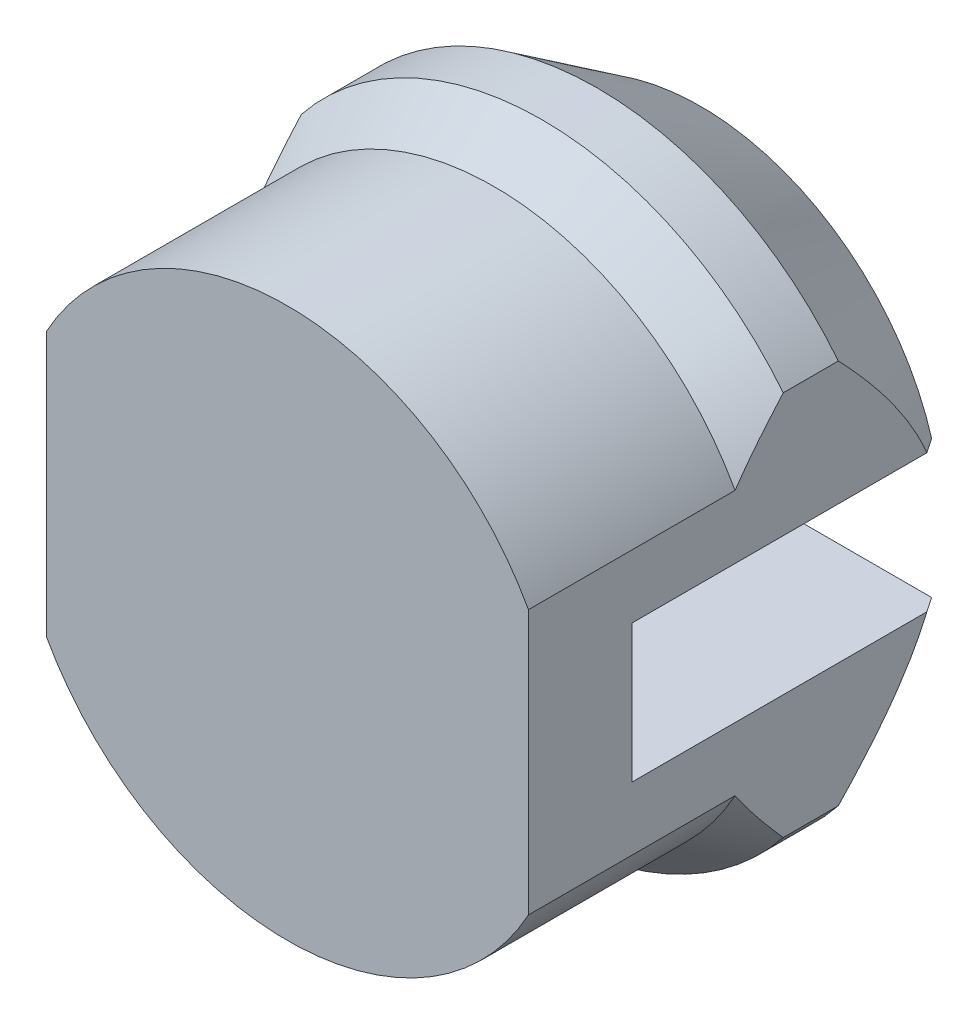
ISO-10303-21;
HEADER;
FILE_DESCRIPTION(('STEP AP214'),'2;1');
FILE_NAME('part.step','',(''),(''),'','','');
FILE_SCHEMA(('AUTOMOTIVE_DESIGN { 1 0 10303 214 1 1 1 1 }'));
ENDSEC;
DATA;
#1=APPLICATION_CONTEXT('core data for automotive mechanical design processes');
#2=APPLICATION_PROTOCOL_DEFINITION('international standard','automotive_design',2000,#1);
#3=PRODUCT_CONTEXT('',#1,'mechanical');
#4=PRODUCT('Part','Part','',(#3));
#5=PRODUCT_RELATED_PRODUCT_CATEGORY('part','',(#4));
#6=PRODUCT_DEFINITION_FORMATION('','',#4);
#7=PRODUCT_DEFINITION_CONTEXT('part definition',#1,'design');
#8=PRODUCT_DEFINITION('design','',#6,#7);
#9=PRODUCT_DEFINITION_SHAPE('','',#8);
#10=(LENGTH_UNIT() NAMED_UNIT(*) SI_UNIT(.MILLI.,.METRE.));
#11=(NAMED_UNIT(*) PLANE_ANGLE_UNIT() SI_UNIT($,.RADIAN.));
#12=(NAMED_UNIT(*) SI_UNIT($,.STERADIAN.) SOLID_ANGLE_UNIT());
#13=UNCERTAINTY_MEASURE_WITH_UNIT(LENGTH_MEASURE(1.E-05),#10,'distance_accuracy_value','');
#14=(GEOMETRIC_REPRESENTATION_CONTEXT(3) GLOBAL_UNCERTAINTY_ASSIGNED_CONTEXT((#13)) GLOBAL_UNIT_ASSIGNED_CONTEXT((#10,
#11,#12)) REPRESENTATION_CONTEXT('',''));
#15=CARTESIAN_POINT('',(0.,0.,0.));
#16=DIRECTION('',(0.,0.,1.));
#17=DIRECTION('',(1.,0.,0.));
#18=AXIS2_PLACEMENT_3D('',#15,#16,#17);
#19=CARTESIAN_POINT('',(0.,0.,-1.50000000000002));
#20=DIRECTION('',(0.,0.,-1.));
#21=DIRECTION('',(-1.,0.,0.));
#22=AXIS2_PLACEMENT_3D('',#19,#20,#21);
#23=CYLINDRICAL_SURFACE('',#22,3.9917400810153);
#24=CARTESIAN_POINT('',(0.,0.,0.));
#25=DIRECTION('',(0.,0.,-1.));
#26=DIRECTION('',(-1.,0.,0.));
#27=AXIS2_PLACEMENT_3D('',#24,#25,#26);
#28=CIRCLE('',#27,3.9917400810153);
#29=CARTESIAN_POINT('',(3.50000000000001,-1.919372,0.));
#30=VERTEX_POINT('',#29);
#31=CARTESIAN_POINT('',(-3.49999999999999,-1.91937200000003,0.));
#32=VERTEX_POINT('',#31);
#33=EDGE_CURVE('E232',#30,#32,#28,.T.);
#34=ORIENTED_EDGE('',*,*,#33,.T.);
#35=DIRECTION('',(0.,0.,-1.));
#36=VECTOR('',#35,1.);
#37=CARTESIAN_POINT('',(-3.49999999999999,-1.91937200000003,-1.50000000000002));
#38=LINE('',#37,#36);
#39=CARTESIAN_POINT('',(-3.49999999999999,-1.91937200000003,-3.00000000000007));
#40=VERTEX_POINT('',#39);
#41=EDGE_CURVE('E163',#32,#40,#38,.T.);
#42=ORIENTED_EDGE('',*,*,#41,.T.);
#43=CARTESIAN_POINT('',(0.,0.,-3.00000000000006));
#44=DIRECTION('',(0.,0.,-1.));
#45=DIRECTION('',(-1.,0.,0.));
#46=AXIS2_PLACEMENT_3D('',#43,#44,#45);
#47=CIRCLE('',#46,3.9917400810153);
#48=CARTESIAN_POINT('',(3.50000000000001,-1.919372,-3.00000000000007));
#49=VERTEX_POINT('',#48);
#50=EDGE_CURVE('E234',#49,#40,#47,.T.);
#51=ORIENTED_EDGE('',*,*,#50,.F.);
#52=DIRECTION('',(0.,0.,-1.));
#53=VECTOR('',#52,1.);
#54=CARTESIAN_POINT('',(3.50000000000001,-1.919372,-1.50000000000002));
#55=LINE('',#54,#53);
#56=EDGE_CURVE('E300',#49,#30,#55,.F.);
#57=ORIENTED_EDGE('',*,*,#56,.T.);
#58=EDGE_LOOP('',(#34,#42,#51,#57));
#59=FACE_BOUND('',#58,.T.);
#60=ADVANCED_FACE('F31',(#59),#23,.T.);
#61=CARTESIAN_POINT('',(0.,0.,-4.50000000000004));
#62=DIRECTION('',(0.,0.,1.));
#63=DIRECTION('',(1.,0.,0.));
#64=AXIS2_PLACEMENT_3D('',#61,#62,#63);
#65=CONICAL_SURFACE('',#64,4.48005192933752,0.578739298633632);
#66=CARTESIAN_POINT('',(0.,0.,-4.50000000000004));
#67=DIRECTION('',(0.,0.,-1.));
#68=DIRECTION('',(-1.,0.,0.));
#69=AXIS2_PLACEMENT_3D('',#66,#67,#68);
#70=CIRCLE('',#69,4.48005192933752);
#71=CARTESIAN_POINT('',(3.50000000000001,-2.79658099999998,-4.50000000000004));
#72=VERTEX_POINT('',#71);
#73=CARTESIAN_POINT('',(-3.49999999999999,-2.79658099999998,-4.50000000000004));
#74=VERTEX_POINT('',#73);
#75=EDGE_CURVE('E179',#72,#74,#70,.T.);
#76=ORIENTED_EDGE('',*,*,#75,.T.);
#77=CARTESIAN_POINT('',(-3.49999999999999,-4.10913992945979,-3.09553037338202));
#78=CARTESIAN_POINT('',(-3.49999999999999,-4.01740323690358,-3.20239201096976));
#79=CARTESIAN_POINT('',(-3.49999999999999,-3.92494303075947,-3.30864234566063));
#80=CARTESIAN_POINT('',(-3.49999999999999,-3.73824976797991,-3.51962826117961));
#81=CARTESIAN_POINT('',(-3.49999999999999,-3.64401619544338,-3.62436338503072));
#82=CARTESIAN_POINT('',(-3.49999999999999,-3.45240665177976,-3.83315922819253));
#83=CARTESIAN_POINT('',(-3.49999999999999,-3.35500698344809,-3.93719827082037));
#84=CARTESIAN_POINT('',(-3.49999999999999,-3.15772319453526,-4.14287686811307));
#85=CARTESIAN_POINT('',(-3.49999999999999,-3.05783936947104,-4.24451670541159));
#86=CARTESIAN_POINT('',(-3.49999999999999,-2.84818236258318,-4.45158608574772));
#87=CARTESIAN_POINT('',(-3.49999999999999,-2.73819854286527,-4.55680341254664));
#88=CARTESIAN_POINT('',(-3.49999999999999,-2.51400086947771,-4.76274699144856));
#89=CARTESIAN_POINT('',(-3.49999999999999,-2.39978553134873,-4.86347163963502));
#90=CARTESIAN_POINT('',(-3.49999999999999,-2.1667709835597,-5.05831645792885));
#91=CARTESIAN_POINT('',(-3.49999999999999,-2.04799704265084,-5.15246663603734));
#92=CARTESIAN_POINT('',(-3.49999999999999,-1.80426647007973,-5.33232312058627));
#93=CARTESIAN_POINT('',(-3.49999999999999,-1.67931575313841,-5.41803727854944));
#94=CARTESIAN_POINT('',(-3.49999999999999,-1.48257030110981,-5.54000315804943));
#95=CARTESIAN_POINT('',(-3.49999999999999,-1.41343607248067,-5.58054753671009));
#96=CARTESIAN_POINT('',(-3.49999999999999,-1.2729099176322,-5.65760976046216));
#97=CARTESIAN_POINT('',(-3.49999999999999,-1.20151725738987,-5.69412627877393));
#98=CARTESIAN_POINT('',(-3.49999999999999,-1.0569944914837,-5.76203006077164));
#99=CARTESIAN_POINT('',(-3.49999999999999,-0.983882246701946,-5.79345505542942));
#100=CARTESIAN_POINT('',(-3.49999999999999,-0.835454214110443,-5.85059764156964));
#101=CARTESIAN_POINT('',(-3.49999999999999,-0.760138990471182,-5.87631668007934));
#102=CARTESIAN_POINT('',(-3.49999999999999,-0.61922833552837,-5.91767267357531));
#103=CARTESIAN_POINT('',(-3.49999999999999,-0.553909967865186,-5.93425031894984));
#104=CARTESIAN_POINT('',(-3.49999999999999,-0.422155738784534,-5.96209739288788));
#105=CARTESIAN_POINT('',(-3.49999999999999,-0.35572017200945,-5.97336819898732));
#106=CARTESIAN_POINT('',(-3.49999999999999,-0.222145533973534,-5.99018688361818));
#107=CARTESIAN_POINT('',(-3.49999999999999,-0.155006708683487,-5.99573669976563));
#108=CARTESIAN_POINT('',(-3.49999999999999,-0.0205219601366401,-6.00089493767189));
#109=CARTESIAN_POINT('',(-3.49999999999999,0.0468238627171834,-6.00050588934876));
#110=CARTESIAN_POINT('',(-3.49999999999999,0.162722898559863,-5.99473135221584));
#111=CARTESIAN_POINT('',(-3.49999999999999,0.211351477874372,-5.99074918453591));
#112=CARTESIAN_POINT('',(-3.49999999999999,0.308228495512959,-5.97977738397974));
#113=CARTESIAN_POINT('',(-3.49999999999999,0.356477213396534,-5.97279022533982));
#114=CARTESIAN_POINT('',(-3.49999999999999,0.404469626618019,-5.96434858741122));
#115=B_SPLINE_CURVE_WITH_KNOTS('',3,(#77,#78,#79,#80,#81,#82,#83,#84,#85,#86,#87,#88,#89,#90,
#91,#92,#93,#94,#95,#96,#97,#98,#99,#100,#101,#102,#103,#104,#105,#106,#107,#108,#109,#110,#111,
#112,#113,#114),.UNSPECIFIED.,.F.,.F.,(4,2,2,2,2,2,2,2,2,2,2,2,2,2,2,2,2,2,4),(0.,
0.422518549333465,0.845161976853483,1.27267536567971,1.70013813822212,2.1566655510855,
2.61335466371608,3.06780075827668,3.52181981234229,3.76215227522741,4.00256366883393,
4.24110278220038,4.47958133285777,4.68155231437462,4.88347083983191,5.08532095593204,
5.28708508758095,5.43336879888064,5.57953229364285),.UNSPECIFIED.);
#116=CARTESIAN_POINT('',(-3.49999999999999,-1.,-5.78564128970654));
#117=VERTEX_POINT('',#116);
#118=EDGE_CURVE('E399',#74,#117,#115,.T.);
#119=ORIENTED_EDGE('',*,*,#118,.T.);
#120=CARTESIAN_POINT('',(-7.97919197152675,-1.,0.951075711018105));
#121=CARTESIAN_POINT('',(-7.7472725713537,-1.,0.598883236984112));
#122=CARTESIAN_POINT('',(-7.51525459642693,-1.,0.246755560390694));
#123=CARTESIAN_POINT('',(-7.05092636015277,-1.,-0.457314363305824));
#124=CARTESIAN_POINT('',(-6.8186160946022,-1.,-0.809256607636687));
#125=CARTESIAN_POINT('',(-6.35341867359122,-1.,-1.51318648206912));
#126=CARTESIAN_POINT('',(-6.12053119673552,-1.,-1.86517389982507));
#127=CARTESIAN_POINT('',(-5.6542268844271,-1.,-2.5687913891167));
#128=CARTESIAN_POINT('',(-5.4208100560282,-1.,-2.92042146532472));
#129=CARTESIAN_POINT('',(-4.94064613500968,-1.,-3.64203991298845));
#130=CARTESIAN_POINT('',(-4.69385642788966,-1.,-4.01199993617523));
#131=CARTESIAN_POINT('',(-4.19893806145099,-1.,-4.75104690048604));
#132=CARTESIAN_POINT('',(-3.95080934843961,-1.,-5.12013380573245));
#133=CARTESIAN_POINT('',(-3.57697381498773,-1.,-5.67248391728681));
#134=CARTESIAN_POINT('',(-3.45212785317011,-1.,-5.85632947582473));
#135=CARTESIAN_POINT('',(-3.20164422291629,-1.,-6.22348014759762));
#136=CARTESIAN_POINT('',(-3.07600655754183,-1.,-6.40678526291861));
#137=CARTESIAN_POINT('',(-2.82362434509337,-1.,-6.77261412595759));
#138=CARTESIAN_POINT('',(-2.69687987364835,-1.,-6.95513792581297));
#139=CARTESIAN_POINT('',(-2.44175614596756,-1.,-7.31903820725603));
#140=CARTESIAN_POINT('',(-2.31337692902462,-1.,-7.50041471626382));
#141=CARTESIAN_POINT('',(-2.13159270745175,-1.,-7.75336688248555));
#142=CARTESIAN_POINT('',(-2.07927557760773,-1.,-7.82572403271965));
#143=CARTESIAN_POINT('',(-1.97411799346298,-1.,-7.97005966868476));
#144=CARTESIAN_POINT('',(-1.92127752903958,-1.,-8.04203814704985));
#145=CARTESIAN_POINT('',(-1.81490032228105,-1.,-8.18557979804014));
#146=CARTESIAN_POINT('',(-1.76136299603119,-1.,-8.25714253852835));
#147=CARTESIAN_POINT('',(-1.65346601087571,-1.,-8.39964179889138));
#148=CARTESIAN_POINT('',(-1.59910638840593,-1.,-8.47057834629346));
#149=CARTESIAN_POINT('',(-1.48977579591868,-1.,-8.61103442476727));
#150=CARTESIAN_POINT('',(-1.43481368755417,-1.,-8.68056083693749));
#151=CARTESIAN_POINT('',(-1.32349988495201,-1.,-8.81849104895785));
#152=CARTESIAN_POINT('',(-1.26714827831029,-1.,-8.88689491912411));
#153=CARTESIAN_POINT('',(-1.15261507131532,-1.,-9.02201266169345));
#154=CARTESIAN_POINT('',(-1.09443583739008,-1.,-9.08872853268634));
#155=CARTESIAN_POINT('',(-0.975423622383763,-1.,-9.21973764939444));
#156=CARTESIAN_POINT('',(-0.914591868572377,-1.,-9.28403199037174));
#157=CARTESIAN_POINT('',(-0.828094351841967,-1.,-9.36986529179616));
#158=CARTESIAN_POINT('',(-0.80411577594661,-1.,-9.39310011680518));
#159=CARTESIAN_POINT('',(-0.755492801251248,-1.,-9.43886218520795));
#160=CARTESIAN_POINT('',(-0.730848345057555,-1.,-9.46138936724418));
#161=CARTESIAN_POINT('',(-0.655578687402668,-1.,-9.52783690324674));
#162=CARTESIAN_POINT('',(-0.603771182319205,-1.,-9.57046703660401));
#163=CARTESIAN_POINT('',(-0.522461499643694,-1.,-9.6304081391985));
#164=CARTESIAN_POINT('',(-0.494542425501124,-1.,-9.64984728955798));
#165=CARTESIAN_POINT('',(-0.437444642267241,-1.,-9.68676638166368));
#166=CARTESIAN_POINT('',(-0.408265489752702,-1.,-9.70424562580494));
#167=CARTESIAN_POINT('',(-0.318867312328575,-1.,-9.75264809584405));
#168=CARTESIAN_POINT('',(-0.256393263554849,-1.,-9.77984777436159));
#169=CARTESIAN_POINT('',(-0.153857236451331,-1.,-9.80934410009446));
#170=CARTESIAN_POINT('',(-0.115450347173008,-1.,-9.81730518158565));
#171=CARTESIAN_POINT('',(-0.0378388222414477,-1.,-9.82637065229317));
#172=CARTESIAN_POINT('',(0.00136475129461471,-1.,-9.82748363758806));
#173=CARTESIAN_POINT('',(0.0792862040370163,-1.,-9.82268210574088));
#174=CARTESIAN_POINT('',(0.11800444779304,-1.,-9.81677322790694));
#175=CARTESIAN_POINT('',(0.194001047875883,-1.,-9.79885597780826));
#176=CARTESIAN_POINT('',(0.231276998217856,-1.,-9.78683784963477));
#177=CARTESIAN_POINT('',(0.328286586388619,-1.,-9.748474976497));
#178=CARTESIAN_POINT('',(0.386330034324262,-1.,-9.71792657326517));
#179=CARTESIAN_POINT('',(0.469710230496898,-1.,-9.66634423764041));
#180=CARTESIAN_POINT('',(0.49695475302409,-1.,-9.64813585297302));
#181=CARTESIAN_POINT('',(0.550370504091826,-1.,-9.61020811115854));
#182=CARTESIAN_POINT('',(0.576542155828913,-1.,-9.59048935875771));
#183=CARTESIAN_POINT('',(0.650601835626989,-1.,-9.53201946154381));
#184=CARTESIAN_POINT('',(0.697319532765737,-1.,-9.49179865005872));
#185=CARTESIAN_POINT('',(0.788353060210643,-1.,-9.40870629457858));
#186=CARTESIAN_POINT('',(0.832667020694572,-1.,-9.36583274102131));
#187=CARTESIAN_POINT('',(0.919572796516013,-1.,-9.27818279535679));
#188=CARTESIAN_POINT('',(0.962160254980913,-1.,-9.23340211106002));
#189=CARTESIAN_POINT('',(1.04593650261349,-1.,-9.14254666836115));
#190=CARTESIAN_POINT('',(1.08712506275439,-1.,-9.09647170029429));
#191=CARTESIAN_POINT('',(1.20950826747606,-1.,-8.95634291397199));
#192=CARTESIAN_POINT('',(1.28906466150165,-1.,-8.86086070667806));
#193=CARTESIAN_POINT('',(1.406256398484,-1.,-8.71606234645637));
#194=CARTESIAN_POINT('',(1.44493328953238,-1.,-8.66757286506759));
#195=CARTESIAN_POINT('',(1.52171043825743,-1.,-8.57014026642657));
#196=CARTESIAN_POINT('',(1.55981071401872,-1.,-8.52119716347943));
#197=CARTESIAN_POINT('',(1.67229624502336,-1.,-8.37526663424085));
#198=CARTESIAN_POINT('',(1.74600429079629,-1.,-8.27775805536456));
#199=CARTESIAN_POINT('',(1.89212255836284,-1.,-8.08177139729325));
#200=CARTESIAN_POINT('',(1.96453272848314,-1.,-7.98329327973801));
#201=CARTESIAN_POINT('',(2.1803618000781,-1.,-7.68680382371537));
#202=CARTESIAN_POINT('',(2.32236150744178,-1.,-7.48776081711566));
#203=CARTESIAN_POINT('',(2.604280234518,-1.,-7.08793345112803));
#204=CARTESIAN_POINT('',(2.7441971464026,-1.,-6.88714761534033));
#205=CARTESIAN_POINT('',(3.02258044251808,-1.,-6.48459510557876));
#206=CARTESIAN_POINT('',(3.16104693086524,-1.,-6.28282850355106));
#207=CARTESIAN_POINT('',(3.43626956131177,-1.,-5.87970147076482));
#208=CARTESIAN_POINT('',(3.5730308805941,-1.,-5.67834456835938));
#209=CARTESIAN_POINT('',(3.8458624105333,-1.,-5.27515799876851));
#210=CARTESIAN_POINT('',(3.98193260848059,-1.,-5.07332832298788));
#211=CARTESIAN_POINT('',(4.38928554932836,-1.,-4.46748377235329));
#212=CARTESIAN_POINT('',(4.65981367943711,-1.,-4.06296176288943));
#213=CARTESIAN_POINT('',(5.18464711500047,-1.,-3.27570518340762));
#214=CARTESIAN_POINT('',(5.43901615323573,-1.,-2.89301302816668));
#215=CARTESIAN_POINT('',(5.9470877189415,-1.,-2.12711956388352));
#216=CARTESIAN_POINT('',(6.20079016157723,-1.,-1.74391819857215));
#217=CARTESIAN_POINT('',(6.70882416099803,-1.,-0.975525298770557));
#218=CARTESIAN_POINT('',(6.9631536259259,-1.,-0.590332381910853));
#219=CARTESIAN_POINT('',(7.47142444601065,-1.,0.18024035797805));
#220=CARTESIAN_POINT('',(7.72536584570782,-1.,0.565620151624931));
#221=CARTESIAN_POINT('',(7.97919197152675,-1.,0.951075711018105));
#222=B_SPLINE_CURVE_WITH_KNOTS('',3,(#120,#121,#122,#123,#124,#125,#126,#127,#128,#129,#130,
#131,#132,#133,#134,#135,#136,#137,#138,#139,#140,#141,#142,#143,#144,#145,#146,#147,#148,#149,
#150,#151,#152,#153,#154,#155,#156,#157,#158,#159,#160,#161,#162,#163,#164,#165,#166,#167,#168,
#169,#170,#171,#172,#173,#174,#175,#176,#177,#178,#179,#180,#181,#182,#183,#184,#185,#186,#187,
#188,#189,#190,#191,#192,#193,#194,#195,#196,#197,#198,#199,#200,#201,#202,#203,#204,#205,#206,
#207,#208,#209,#210,#211,#212,#213,#214,#215,#216,#217,#218,#219,#220,#221),.UNSPECIFIED.,.F.,
.F.,(4,2,2,2,2,2,2,2,2,2,2,2,2,2,2,2,2,2,2,2,2,2,2,2,2,2,2,2,2,2,2,2,2,2,2,2,2,2,2,2,2,2,2,2,2,
2,2,2,2,2,4),(0.,1.26508325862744,2.53018492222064,3.79635421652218,5.06250673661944,
6.39666447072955,7.73087610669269,8.39756160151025,9.06424451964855,9.73088223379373,
10.3975039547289,10.6653711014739,10.9332434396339,11.2013568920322,11.4694584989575,
11.7353273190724,12.0011794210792,12.2667004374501,12.5320998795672,12.6322532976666,
12.7324153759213,12.9333966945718,13.0353790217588,13.1373975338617,13.3399386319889,
13.4570919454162,13.5740981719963,13.6910104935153,13.808110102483,14.0036820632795,
14.1019749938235,14.2002287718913,14.384999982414,14.5699129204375,14.7552666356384,
14.9406505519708,15.3133920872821,15.499467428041,15.6855369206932,16.0522178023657,
16.4189132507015,17.1523923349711,17.8865691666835,18.6206929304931,19.3509201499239,
20.0811607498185,21.5410920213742,22.9196455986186,24.2983668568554,25.6831097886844,
27.0676796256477),.UNSPECIFIED.);
#223=CARTESIAN_POINT('',(-3.35410176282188,-1.,-6.00000000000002));
#224=VERTEX_POINT('',#223);
#225=EDGE_CURVE('E339',#117,#224,#222,.T.);
#226=ORIENTED_EDGE('',*,*,#225,.T.);
#227=CARTESIAN_POINT('',(0.,0.,-6.00000000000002));
#228=DIRECTION('',(0.,0.,-1.));
#229=DIRECTION('',(-1.,0.,0.));
#230=AXIS2_PLACEMENT_3D('',#227,#228,#229);
#231=CIRCLE('',#230,3.49999980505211);
#232=CARTESIAN_POINT('',(3.35410176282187,-1.,-6.00000000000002));
#233=VERTEX_POINT('',#232);
#234=EDGE_CURVE('E208',#233,#224,#231,.T.);
#235=ORIENTED_EDGE('',*,*,#234,.F.);
#236=CARTESIAN_POINT('',(3.50000000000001,-1.,-5.78564128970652));
#237=VERTEX_POINT('',#236);
#238=EDGE_CURVE('E334',#233,#237,#222,.T.);
#239=ORIENTED_EDGE('',*,*,#238,.T.);
#240=CARTESIAN_POINT('',(3.50000000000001,0.40446962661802,-5.9643485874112));
#241=CARTESIAN_POINT('',(3.50000000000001,0.337036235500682,-5.97624006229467));
#242=CARTESIAN_POINT('',(3.50000000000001,0.269075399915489,-5.98521557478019));
#243=CARTESIAN_POINT('',(3.50000000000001,0.132656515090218,-5.99715475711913));
#244=CARTESIAN_POINT('',(3.50000000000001,0.0641986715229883,-6.00012078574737));
#245=CARTESIAN_POINT('',(3.50000000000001,-0.0718239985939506,-5.99987231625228));
#246=CARTESIAN_POINT('',(3.50000000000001,-0.139388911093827,-5.99673734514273));
#247=CARTESIAN_POINT('',(3.50000000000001,-0.273969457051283,-5.98459871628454));
#248=CARTESIAN_POINT('',(3.50000000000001,-0.340985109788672,-5.97559526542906));
#249=CARTESIAN_POINT('',(3.50000000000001,-0.540408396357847,-5.94027349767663));
#250=CARTESIAN_POINT('',(3.50000000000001,-0.671393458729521,-5.90564180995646));
#251=CARTESIAN_POINT('',(3.50000000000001,-0.927391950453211,-5.8184662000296));
#252=CARTESIAN_POINT('',(3.50000000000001,-1.05238699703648,-5.76587071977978));
#253=CARTESIAN_POINT('',(3.50000000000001,-1.29869326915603,-5.64597840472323));
#254=CARTESIAN_POINT('',(3.50000000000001,-1.41984458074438,-5.57835965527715));
#255=CARTESIAN_POINT('',(3.50000000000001,-1.65597195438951,-5.43298375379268));
#256=CARTESIAN_POINT('',(3.50000000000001,-1.77094090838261,-5.35521526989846));
#257=CARTESIAN_POINT('',(3.50000000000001,-1.99628631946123,-5.19179054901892));
#258=CARTESIAN_POINT('',(3.50000000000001,-2.10662537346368,-5.10608332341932));
#259=CARTESIAN_POINT('',(3.50000000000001,-2.32280786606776,-4.9291558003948));
#260=CARTESIAN_POINT('',(3.50000000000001,-2.42864984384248,-4.83793373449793));
#261=CARTESIAN_POINT('',(3.50000000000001,-2.67604257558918,-4.61597348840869));
#262=CARTESIAN_POINT('',(3.50000000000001,-2.81591217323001,-4.48336960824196));
#263=CARTESIAN_POINT('',(3.50000000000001,-3.09023511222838,-4.21260685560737));
#264=CARTESIAN_POINT('',(3.50000000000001,-3.22468593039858,-4.07444545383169));
#265=CARTESIAN_POINT('',(3.50000000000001,-3.48596316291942,-3.7976336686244));
#266=CARTESIAN_POINT('',(3.50000000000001,-3.61289636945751,-3.65908368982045));
#267=CARTESIAN_POINT('',(3.50000000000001,-3.8007838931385,-3.44916033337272));
#268=CARTESIAN_POINT('',(3.50000000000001,-3.86296147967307,-3.37887463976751));
#269=CARTESIAN_POINT('',(3.50000000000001,-3.98658158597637,-3.23766297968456));
#270=CARTESIAN_POINT('',(3.50000000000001,-4.04802412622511,-3.16673703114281));
#271=CARTESIAN_POINT('',(3.50000000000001,-4.10913992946,-3.09553037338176));
#272=B_SPLINE_CURVE_WITH_KNOTS('',3,(#240,#241,#242,#243,#244,#245,#246,#247,#248,#249,#250,
#251,#252,#253,#254,#255,#256,#257,#258,#259,#260,#261,#262,#263,#264,#265,#266,#267,#268,#269,
#270,#271),.UNSPECIFIED.,.F.,.F.,(4,2,2,2,2,2,2,2,2,2,2,2,2,2,2,4),(0.,0.205378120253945,
0.41067561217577,0.613314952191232,0.815947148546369,1.22061615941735,1.62645651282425,
2.04201627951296,2.45804403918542,2.87695861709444,3.29600825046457,3.87398620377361,
4.45223024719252,5.01587585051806,5.29739500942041,5.57890630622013),.UNSPECIFIED.);
#273=EDGE_CURVE('E290',#237,#72,#272,.T.);
#274=ORIENTED_EDGE('',*,*,#273,.T.);
#275=EDGE_LOOP('',(#76,#119,#226,#235,#239,#274));
#276=FACE_BOUND('',#275,.T.);
#277=ADVANCED_FACE('F362',(#276),#65,.T.);
#278=CARTESIAN_POINT('',(0.,0.,-1.50000000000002));
#279=DIRECTION('',(0.,0.,-1.));
#280=DIRECTION('',(-1.,0.,0.));
#281=AXIS2_PLACEMENT_3D('',#278,#279,#280);
#282=CYLINDRICAL_SURFACE('',#281,4.48005192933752);
#283=CARTESIAN_POINT('',(0.,0.,-3.70000000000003));
#284=DIRECTION('',(0.,0.,-1.));
#285=DIRECTION('',(-1.,0.,0.));
#286=AXIS2_PLACEMENT_3D('',#283,#284,#285);
#287=CIRCLE('',#286,4.48005192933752);
#288=CARTESIAN_POINT('',(3.50000000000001,-2.79658099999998,-3.70000000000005));
#289=VERTEX_POINT('',#288);
#290=CARTESIAN_POINT('',(-3.49999999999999,-2.79658099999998,-3.70000000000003));
#291=VERTEX_POINT('',#290);
#292=EDGE_CURVE('E180',#289,#291,#287,.T.);
#293=ORIENTED_EDGE('',*,*,#292,.T.);
#294=DIRECTION('',(0.,0.,-1.));
#295=VECTOR('',#294,1.);
#296=CARTESIAN_POINT('',(-3.49999999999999,-2.79658099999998,0.));
#297=LINE('',#296,#295);
#298=EDGE_CURVE('E172',#291,#74,#297,.T.);
#299=ORIENTED_EDGE('',*,*,#298,.T.);
#300=ORIENTED_EDGE('',*,*,#75,.F.);
#301=DIRECTION('',(0.,0.,-1.));
#302=VECTOR('',#301,1.);
#303=CARTESIAN_POINT('',(3.50000000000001,-2.79658099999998,0.));
#304=LINE('',#303,#302);
#305=EDGE_CURVE('E257',#289,#72,#304,.T.);
#306=ORIENTED_EDGE('',*,*,#305,.F.);
#307=EDGE_LOOP('',(#293,#299,#300,#306));
#308=FACE_BOUND('',#307,.T.);
#309=ADVANCED_FACE('F366',(#308),#282,.T.);
#310=CARTESIAN_POINT('',(0.,0.,-3.00000000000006));
#311=DIRECTION('',(0.,0.,-1.));
#312=DIRECTION('',(-1.,0.,0.));
#313=AXIS2_PLACEMENT_3D('',#310,#311,#312);
#314=CONICAL_SURFACE('',#313,3.9917400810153,0.609105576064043);
#315=ORIENTED_EDGE('',*,*,#50,.T.);
#316=CARTESIAN_POINT('',(-3.49999999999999,0.157080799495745,-2.3001360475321));
#317=CARTESIAN_POINT('',(-3.49999999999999,0.0810039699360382,-2.29518651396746));
#318=CARTESIAN_POINT('',(-3.49999999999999,0.00470697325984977,-2.29388546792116));
#319=CARTESIAN_POINT('',(-3.49999999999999,-0.147562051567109,-2.29837507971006));
#320=CARTESIAN_POINT('',(-3.49999999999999,-0.223534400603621,-2.30415470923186));
#321=CARTESIAN_POINT('',(-3.49999999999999,-0.372959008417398,-2.32238249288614));
#322=CARTESIAN_POINT('',(-3.49999999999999,-0.446429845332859,-2.33468036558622));
#323=CARTESIAN_POINT('',(-3.49999999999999,-0.59210983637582,-2.36532779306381));
#324=CARTESIAN_POINT('',(-3.49999999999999,-0.664318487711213,-2.38367970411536));
#325=CARTESIAN_POINT('',(-3.49999999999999,-0.835245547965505,-2.43408469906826));
#326=CARTESIAN_POINT('',(-3.49999999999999,-0.933212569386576,-2.46868749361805));
#327=CARTESIAN_POINT('',(-3.49999999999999,-1.12564813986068,-2.54651898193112));
#328=CARTESIAN_POINT('',(-3.49999999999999,-1.22011476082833,-2.58975234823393));
#329=CARTESIAN_POINT('',(-3.49999999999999,-1.40733073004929,-2.68400551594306));
#330=CARTESIAN_POINT('',(-3.49999999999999,-1.50001196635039,-2.7351592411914));
#331=CARTESIAN_POINT('',(-3.49999999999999,-1.68196768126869,-2.8430988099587));
#332=CARTESIAN_POINT('',(-3.49999999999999,-1.77124301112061,-2.89988323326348));
#333=CARTESIAN_POINT('',(-3.49999999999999,-1.95973790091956,-3.02663228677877));
#334=CARTESIAN_POINT('',(-3.49999999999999,-2.05847869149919,-3.09730487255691));
#335=CARTESIAN_POINT('',(-3.49999999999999,-2.25255845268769,-3.24319968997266));
#336=CARTESIAN_POINT('',(-3.49999999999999,-2.34789637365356,-3.31842330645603));
#337=CARTESIAN_POINT('',(-3.49999999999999,-2.5358206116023,-3.47256107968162));
#338=CARTESIAN_POINT('',(-3.49999999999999,-2.62840152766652,-3.55148178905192));
#339=CARTESIAN_POINT('',(-3.49999999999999,-2.81107244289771,-3.71215773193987));
#340=CARTESIAN_POINT('',(-3.49999999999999,-2.90116224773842,-3.79391318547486));
#341=CARTESIAN_POINT('',(-3.49999999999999,-3.0738020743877,-3.95466816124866));
#342=CARTESIAN_POINT('',(-3.49999999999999,-3.15647763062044,-4.03353332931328));
#343=CARTESIAN_POINT('',(-3.49999999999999,-3.32020775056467,-4.19293341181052));
#344=CARTESIAN_POINT('',(-3.49999999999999,-3.40126223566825,-4.27346840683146));
#345=CARTESIAN_POINT('',(-3.49999999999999,-3.56157469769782,-4.43553823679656));
#346=CARTESIAN_POINT('',(-3.49999999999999,-3.64083944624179,-4.51706638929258));
#347=CARTESIAN_POINT('',(-3.49999999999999,-3.79813207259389,-4.68128371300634));
#348=CARTESIAN_POINT('',(-3.49999999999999,-3.87616014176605,-4.76397270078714));
#349=CARTESIAN_POINT('',(-3.49999999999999,-3.95366179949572,-4.8471465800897));
#350=B_SPLINE_CURVE_WITH_KNOTS('',3,(#316,#317,#318,#319,#320,#321,#322,#323,#324,#325,#326,
#327,#328,#329,#330,#331,#332,#333,#334,#335,#336,#337,#338,#339,#340,#341,#342,#343,#344,#345,
#346,#347,#348,#349),.UNSPECIFIED.,.F.,.F.,(4,2,2,2,2,2,2,2,2,2,2,2,2,2,2,2,4),(0.,
0.228602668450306,0.456849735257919,0.680049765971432,0.903336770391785,1.21450213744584,
1.52583642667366,1.84316673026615,2.16041719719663,2.52452488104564,2.88874392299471,
3.25363491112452,3.61855428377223,3.96130209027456,4.30406647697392,4.64518024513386,
4.98624070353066),.UNSPECIFIED.);
#351=EDGE_CURVE('E255',#40,#291,#350,.T.);
#352=ORIENTED_EDGE('',*,*,#351,.T.);
#353=ORIENTED_EDGE('',*,*,#292,.F.);
#354=CARTESIAN_POINT('',(3.50000000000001,-3.95366179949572,-4.84714658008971));
#355=CARTESIAN_POINT('',(3.50000000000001,-3.86178665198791,-4.74855838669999));
#356=CARTESIAN_POINT('',(3.50000000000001,-3.76917784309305,-4.65064212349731));
#357=CARTESIAN_POINT('',(3.50000000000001,-3.58216334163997,-4.45647837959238));
#358=CARTESIAN_POINT('',(3.50000000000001,-3.48775704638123,-4.36023148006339));
#359=CARTESIAN_POINT('',(3.50000000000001,-3.29556095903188,-4.16848288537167));
#360=CARTESIAN_POINT('',(3.50000000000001,-3.19774243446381,-4.07300988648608));
#361=CARTESIAN_POINT('',(3.50000000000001,-2.9995956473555,-3.8847218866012));
#362=CARTESIAN_POINT('',(3.50000000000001,-2.899267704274,-3.79190655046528));
#363=CARTESIAN_POINT('',(3.50000000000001,-2.6872691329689,-3.60216363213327));
#364=CARTESIAN_POINT('',(3.50000000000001,-2.57534208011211,-3.50552091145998));
#365=CARTESIAN_POINT('',(3.50000000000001,-2.34715382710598,-3.31735573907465));
#366=CARTESIAN_POINT('',(3.50000000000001,-2.23089092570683,-3.22583533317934));
#367=CARTESIAN_POINT('',(3.50000000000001,-1.99386815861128,-3.05028522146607));
#368=CARTESIAN_POINT('',(3.50000000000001,-1.87313912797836,-2.96621422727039));
#369=CARTESIAN_POINT('',(3.50000000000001,-1.62563135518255,-2.80758930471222));
#370=CARTESIAN_POINT('',(3.50000000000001,-1.49885923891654,-2.73302526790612));
#371=CARTESIAN_POINT('',(3.50000000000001,-1.29540209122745,-2.62681596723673));
#372=CARTESIAN_POINT('',(3.50000000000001,-1.22106913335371,-2.59066583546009));
#373=CARTESIAN_POINT('',(3.50000000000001,-1.0701180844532,-2.52335100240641));
#374=CARTESIAN_POINT('',(3.50000000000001,-0.993499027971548,-2.49218844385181));
#375=CARTESIAN_POINT('',(3.50000000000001,-0.839309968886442,-2.436240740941));
#376=CARTESIAN_POINT('',(3.50000000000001,-0.761774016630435,-2.41136277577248));
#377=CARTESIAN_POINT('',(3.50000000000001,-0.604879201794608,-2.36826460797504));
#378=CARTESIAN_POINT('',(3.50000000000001,-0.525520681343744,-2.35004316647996));
#379=CARTESIAN_POINT('',(3.50000000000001,-0.346895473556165,-2.31772767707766));
#380=CARTESIAN_POINT('',(3.50000000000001,-0.247263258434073,-2.3055583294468));
#381=CARTESIAN_POINT('',(3.50000000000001,-0.0966384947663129,-2.296470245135));
#382=CARTESIAN_POINT('',(3.50000000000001,-0.0458857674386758,-2.29499046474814));
#383=CARTESIAN_POINT('',(3.50000000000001,0.055634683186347,-2.29519045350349));
#384=CARTESIAN_POINT('',(3.50000000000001,0.106402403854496,-2.29687154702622));
#385=CARTESIAN_POINT('',(3.50000000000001,0.157080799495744,-2.30013604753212));
#386=B_SPLINE_CURVE_WITH_KNOTS('',3,(#354,#355,#356,#357,#358,#359,#360,#361,#362,#363,#364,
#365,#366,#367,#368,#369,#370,#371,#372,#373,#374,#375,#376,#377,#378,#379,#380,#381,#382,#383,
#384,#385),.UNSPECIFIED.,.F.,.F.,(4,2,2,2,2,2,2,2,2,2,2,2,2,2,2,4),(0.,0.404293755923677,
0.808725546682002,1.21874838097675,1.62871928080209,2.07223296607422,2.51592254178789,
2.9569750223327,3.39755456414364,3.64537912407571,3.89330986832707,4.13733079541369,
4.38130628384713,4.68161984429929,4.83385662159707,4.98615719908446),.UNSPECIFIED.);
#387=EDGE_CURVE('E251',#289,#49,#386,.T.);
#388=ORIENTED_EDGE('',*,*,#387,.T.);
#389=EDGE_LOOP('',(#315,#352,#353,#388));
#390=FACE_BOUND('',#389,.T.);
#391=ADVANCED_FACE('F304',(#390),#314,.T.);
#392=CARTESIAN_POINT('',(0.,0.,-1.50000000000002));
#393=DIRECTION('',(0.,0.,-1.));
#394=DIRECTION('',(-1.,0.,0.));
#395=AXIS2_PLACEMENT_3D('',#392,#393,#394);
#396=CYLINDRICAL_SURFACE('',#395,1.58900472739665);
#397=CARTESIAN_POINT('',(0.,0.,-6.00000000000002));
#398=DIRECTION('',(0.,0.,-1.));
#399=DIRECTION('',(-1.,0.,0.));
#400=AXIS2_PLACEMENT_3D('',#397,#398,#399);
#401=CIRCLE('',#400,1.58900472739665);
#402=CARTESIAN_POINT('',(1.23488299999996,-1.,-6.00000000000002));
#403=VERTEX_POINT('',#402);
#404=CARTESIAN_POINT('',(-1.23488299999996,-1.,-6.00000000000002));
#405=VERTEX_POINT('',#404);
#406=EDGE_CURVE('E206',#403,#405,#401,.T.);
#407=ORIENTED_EDGE('',*,*,#406,.T.);
#408=DIRECTION('',(0.,0.,-1.));
#409=VECTOR('',#408,1.);
#410=CARTESIAN_POINT('',(-1.23488299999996,-1.,-1.50000000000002));
#411=LINE('',#410,#409);
#412=CARTESIAN_POINT('',(-1.23488299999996,-1.,-1.50000000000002));
#413=VERTEX_POINT('',#412);
#414=EDGE_CURVE('E216',#405,#413,#411,.F.);
#415=ORIENTED_EDGE('',*,*,#414,.T.);
#416=CARTESIAN_POINT('',(0.,0.,-1.50000000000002));
#417=DIRECTION('',(0.,0.,-1.));
#418=DIRECTION('',(-1.,0.,0.));
#419=AXIS2_PLACEMENT_3D('',#416,#417,#418);
#420=CIRCLE('',#419,1.58900472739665);
#421=CARTESIAN_POINT('',(1.23488299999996,-1.,-1.50000000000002));
#422=VERTEX_POINT('',#421);
#423=EDGE_CURVE('E224',#422,#413,#420,.T.);
#424=ORIENTED_EDGE('',*,*,#423,.F.);
#425=DIRECTION('',(0.,0.,-1.));
#426=VECTOR('',#425,1.);
#427=CARTESIAN_POINT('',(1.23488299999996,-1.,-1.50000000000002));
#428=LINE('',#427,#426);
#429=EDGE_CURVE('E219',#422,#403,#428,.T.);
#430=ORIENTED_EDGE('',*,*,#429,.T.);
#431=EDGE_LOOP('',(#407,#415,#424,#430));
#432=FACE_BOUND('',#431,.T.);
#433=ADVANCED_FACE('F214',(#432),#396,.F.);
#434=CARTESIAN_POINT('',(3.49999980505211,0.,-6.00000000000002));
#435=DIRECTION('',(0.,0.,1.));
#436=DIRECTION('',(1.,0.,0.));
#437=AXIS2_PLACEMENT_3D('',#434,#435,#436);
#438=PLANE('',#437);
#439=ORIENTED_EDGE('',*,*,#234,.T.);
#440=DIRECTION('',(1.,0.,0.));
#441=VECTOR('',#440,1.);
#442=CARTESIAN_POINT('',(3.49999980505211,-1.,-6.00000000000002));
#443=LINE('',#442,#441);
#444=EDGE_CURVE('E195',#224,#405,#443,.T.);
#445=ORIENTED_EDGE('',*,*,#444,.T.);
#446=ORIENTED_EDGE('',*,*,#406,.F.);
#447=EDGE_CURVE('E193',#403,#233,#443,.T.);
#448=ORIENTED_EDGE('',*,*,#447,.T.);
#449=EDGE_LOOP('',(#439,#445,#446,#448));
#450=FACE_BOUND('',#449,.T.);
#451=ADVANCED_FACE('F205',(#450),#438,.F.);
#452=CARTESIAN_POINT('',(7.97919197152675,1.,0.951075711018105));
#453=CARTESIAN_POINT('',(7.74727257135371,1.,0.598883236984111));
#454=CARTESIAN_POINT('',(7.51525459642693,1.,0.246755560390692));
#455=CARTESIAN_POINT('',(7.05092636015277,1.,-0.457314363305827));
#456=CARTESIAN_POINT('',(6.8186160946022,1.,-0.809256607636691));
#457=CARTESIAN_POINT('',(6.35341867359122,1.,-1.51318648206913));
#458=CARTESIAN_POINT('',(6.12053119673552,1.,-1.86517389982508));
#459=CARTESIAN_POINT('',(5.6542268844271,1.,-2.56879138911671));
#460=CARTESIAN_POINT('',(5.4208100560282,1.,-2.92042146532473));
#461=CARTESIAN_POINT('',(4.94064613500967,1.,-3.64203991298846));
#462=CARTESIAN_POINT('',(4.69385642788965,1.,-4.01199993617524));
#463=CARTESIAN_POINT('',(4.19893806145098,1.,-4.75104690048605));
#464=CARTESIAN_POINT('',(3.95080934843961,1.,-5.12013380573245));
#465=CARTESIAN_POINT('',(3.57697381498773,1.,-5.67248391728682));
#466=CARTESIAN_POINT('',(3.45212785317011,1.,-5.85632947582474));
#467=CARTESIAN_POINT('',(3.20164422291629,1.,-6.22348014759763));
#468=CARTESIAN_POINT('',(3.07600655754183,1.,-6.40678526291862));
#469=CARTESIAN_POINT('',(2.82362434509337,1.,-6.7726141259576));
#470=CARTESIAN_POINT('',(2.69687987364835,1.,-6.95513792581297));
#471=CARTESIAN_POINT('',(2.44175614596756,1.,-7.31903820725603));
#472=CARTESIAN_POINT('',(2.31337692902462,1.,-7.50041471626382));
#473=CARTESIAN_POINT('',(2.13159270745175,1.,-7.75336688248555));
#474=CARTESIAN_POINT('',(2.07927557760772,1.,-7.82572403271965));
#475=CARTESIAN_POINT('',(1.97411799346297,1.,-7.97005966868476));
#476=CARTESIAN_POINT('',(1.92127752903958,1.,-8.04203814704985));
#477=CARTESIAN_POINT('',(1.81490032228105,1.,-8.18557979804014));
#478=CARTESIAN_POINT('',(1.76136299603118,1.,-8.25714253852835));
#479=CARTESIAN_POINT('',(1.65346601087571,1.,-8.39964179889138));
#480=CARTESIAN_POINT('',(1.59910638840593,1.,-8.47057834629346));
#481=CARTESIAN_POINT('',(1.48977579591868,1.,-8.61103442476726));
#482=CARTESIAN_POINT('',(1.43481368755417,1.,-8.68056083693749));
#483=CARTESIAN_POINT('',(1.32349988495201,1.,-8.81849104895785));
#484=CARTESIAN_POINT('',(1.26714827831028,1.,-8.88689491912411));
#485=CARTESIAN_POINT('',(1.15261507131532,1.,-9.02201266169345));
#486=CARTESIAN_POINT('',(1.09443583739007,1.,-9.08872853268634));
#487=CARTESIAN_POINT('',(0.97542362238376,1.,-9.21973764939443));
#488=CARTESIAN_POINT('',(0.914591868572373,1.,-9.28403199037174));
#489=CARTESIAN_POINT('',(0.828094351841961,1.,-9.36986529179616));
#490=CARTESIAN_POINT('',(0.804115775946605,1.,-9.39310011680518));
#491=CARTESIAN_POINT('',(0.755492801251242,1.,-9.43886218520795));
#492=CARTESIAN_POINT('',(0.73084834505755,1.,-9.46138936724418));
#493=CARTESIAN_POINT('',(0.655578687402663,1.,-9.52783690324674));
#494=CARTESIAN_POINT('',(0.6037711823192,1.,-9.57046703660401));
#495=CARTESIAN_POINT('',(0.522461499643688,1.,-9.6304081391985));
#496=CARTESIAN_POINT('',(0.494542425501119,1.,-9.64984728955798));
#497=CARTESIAN_POINT('',(0.437444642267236,1.,-9.68676638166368));
#498=CARTESIAN_POINT('',(0.408265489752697,1.,-9.70424562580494));
#499=CARTESIAN_POINT('',(0.318867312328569,1.,-9.75264809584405));
#500=CARTESIAN_POINT('',(0.256393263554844,1.,-9.77984777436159));
#501=CARTESIAN_POINT('',(0.153857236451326,1.,-9.80934410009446));
#502=CARTESIAN_POINT('',(0.115450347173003,1.,-9.81730518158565));
#503=CARTESIAN_POINT('',(0.0378388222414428,1.,-9.82637065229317));
#504=CARTESIAN_POINT('',(-0.00136475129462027,1.,-9.82748363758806));
#505=CARTESIAN_POINT('',(-0.0792862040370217,1.,-9.82268210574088));
#506=CARTESIAN_POINT('',(-0.118004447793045,1.,-9.81677322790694));
#507=CARTESIAN_POINT('',(-0.194001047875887,1.,-9.79885597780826));
#508=CARTESIAN_POINT('',(-0.231276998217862,1.,-9.78683784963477));
#509=CARTESIAN_POINT('',(-0.328286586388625,1.,-9.748474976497));
#510=CARTESIAN_POINT('',(-0.386330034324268,1.,-9.71792657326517));
#511=CARTESIAN_POINT('',(-0.469710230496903,1.,-9.66634423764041));
#512=CARTESIAN_POINT('',(-0.496954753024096,1.,-9.64813585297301));
#513=CARTESIAN_POINT('',(-0.550370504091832,1.,-9.61020811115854));
#514=CARTESIAN_POINT('',(-0.576542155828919,1.,-9.59048935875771));
#515=CARTESIAN_POINT('',(-0.650601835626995,1.,-9.53201946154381));
#516=CARTESIAN_POINT('',(-0.697319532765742,1.,-9.49179865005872));
#517=CARTESIAN_POINT('',(-0.788353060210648,1.,-9.40870629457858));
#518=CARTESIAN_POINT('',(-0.832667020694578,1.,-9.36583274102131));
#519=CARTESIAN_POINT('',(-0.919572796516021,1.,-9.27818279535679));
#520=CARTESIAN_POINT('',(-0.962160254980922,1.,-9.23340211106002));
#521=CARTESIAN_POINT('',(-1.0459365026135,1.,-9.14254666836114));
#522=CARTESIAN_POINT('',(-1.0871250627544,1.,-9.09647170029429));
#523=CARTESIAN_POINT('',(-1.20950826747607,1.,-8.95634291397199));
#524=CARTESIAN_POINT('',(-1.28906466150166,1.,-8.86086070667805));
#525=CARTESIAN_POINT('',(-1.406256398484,1.,-8.71606234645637));
#526=CARTESIAN_POINT('',(-1.44493328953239,1.,-8.66757286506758));
#527=CARTESIAN_POINT('',(-1.52171043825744,1.,-8.57014026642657));
#528=CARTESIAN_POINT('',(-1.55981071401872,1.,-8.52119716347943));
#529=CARTESIAN_POINT('',(-1.67229624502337,1.,-8.37526663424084));
#530=CARTESIAN_POINT('',(-1.7460042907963,1.,-8.27775805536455));
#531=CARTESIAN_POINT('',(-1.89212255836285,1.,-8.08177139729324));
#532=CARTESIAN_POINT('',(-1.96453272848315,1.,-7.983293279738));
#533=CARTESIAN_POINT('',(-2.18036180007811,1.,-7.68680382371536));
#534=CARTESIAN_POINT('',(-2.32236150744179,1.,-7.48776081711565));
#535=CARTESIAN_POINT('',(-2.60428023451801,1.,-7.08793345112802));
#536=CARTESIAN_POINT('',(-2.74419714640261,1.,-6.88714761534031));
#537=CARTESIAN_POINT('',(-3.02258044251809,1.,-6.48459510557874));
#538=CARTESIAN_POINT('',(-3.16104693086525,1.,-6.28282850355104));
#539=CARTESIAN_POINT('',(-3.43626956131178,1.,-5.8797014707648));
#540=CARTESIAN_POINT('',(-3.57303088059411,1.,-5.67834456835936));
#541=CARTESIAN_POINT('',(-3.84586241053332,1.,-5.27515799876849));
#542=CARTESIAN_POINT('',(-3.98193260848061,1.,-5.07332832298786));
#543=CARTESIAN_POINT('',(-4.38928554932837,1.,-4.46748377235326));
#544=CARTESIAN_POINT('',(-4.65981367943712,1.,-4.06296176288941));
#545=CARTESIAN_POINT('',(-5.18464711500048,1.,-3.27570518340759));
#546=CARTESIAN_POINT('',(-5.43901615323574,1.,-2.89301302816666));
#547=CARTESIAN_POINT('',(-5.94708771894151,1.,-2.1271195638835));
#548=CARTESIAN_POINT('',(-6.20079016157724,1.,-1.74391819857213));
#549=CARTESIAN_POINT('',(-6.70882416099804,1.,-0.975525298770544));
#550=CARTESIAN_POINT('',(-6.9631536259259,1.,-0.590332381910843));
#551=CARTESIAN_POINT('',(-7.47142444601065,1.,0.180240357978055));
#552=CARTESIAN_POINT('',(-7.72536584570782,1.,0.565620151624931));
#553=CARTESIAN_POINT('',(-7.97919197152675,1.,0.951075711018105));
#554=B_SPLINE_CURVE_WITH_KNOTS('',3,(#452,#453,#454,#455,#456,#457,#458,#459,#460,#461,#462,
#463,#464,#465,#466,#467,#468,#469,#470,#471,#472,#473,#474,#475,#476,#477,#478,#479,#480,#481,
#482,#483,#484,#485,#486,#487,#488,#489,#490,#491,#492,#493,#494,#495,#496,#497,#498,#499,#500,
#501,#502,#503,#504,#505,#506,#507,#508,#509,#510,#511,#512,#513,#514,#515,#516,#517,#518,#519,
#520,#521,#522,#523,#524,#525,#526,#527,#528,#529,#530,#531,#532,#533,#534,#535,#536,#537,#538,
#539,#540,#541,#542,#543,#544,#545,#546,#547,#548,#549,#550,#551,#552,#553),.UNSPECIFIED.,.F.,
.F.,(4,2,2,2,2,2,2,2,2,2,2,2,2,2,2,2,2,2,2,2,2,2,2,2,2,2,2,2,2,2,2,2,2,2,2,2,2,2,2,2,2,2,2,2,2,
2,2,2,2,2,4),(0.,1.26508325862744,2.53018492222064,3.79635421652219,5.06250673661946,
6.39666447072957,7.7308761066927,8.39756160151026,9.06424451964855,9.73088223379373,
10.3975039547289,10.6653711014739,10.9332434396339,11.2013568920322,11.4694584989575,
11.7353273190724,12.0011794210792,12.2667004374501,12.5320998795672,12.6322532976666,
12.7324153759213,12.9333966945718,13.0353790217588,13.1373975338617,13.3399386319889,
13.4570919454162,13.5740981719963,13.6910104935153,13.808110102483,14.0036820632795,
14.1019749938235,14.2002287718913,14.384999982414,14.5699129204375,14.7552666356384,
14.9406505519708,15.3133920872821,15.499467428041,15.6855369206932,16.0522178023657,
16.4189132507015,17.1523923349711,17.8865691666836,18.6206929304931,19.3509201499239,
20.0811607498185,21.5410920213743,22.9196455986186,24.2983668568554,25.6831097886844,
27.0676796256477),.UNSPECIFIED.);
#555=CARTESIAN_POINT('',(-3.35410176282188,1.,-6.00000000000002));
#556=VERTEX_POINT('',#555);
#557=CARTESIAN_POINT('',(-3.49999999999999,1.,-5.78564128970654));
#558=VERTEX_POINT('',#557);
#559=EDGE_CURVE('E326',#556,#558,#554,.T.);
#560=ORIENTED_EDGE('',*,*,#559,.T.);
#561=CARTESIAN_POINT('',(-3.49999999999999,-0.40446962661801,-5.96434858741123));
#562=CARTESIAN_POINT('',(-3.49999999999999,-0.337036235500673,-5.97624006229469));
#563=CARTESIAN_POINT('',(-3.49999999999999,-0.26907539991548,-5.98521557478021));
#564=CARTESIAN_POINT('',(-3.49999999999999,-0.132656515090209,-5.99715475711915));
#565=CARTESIAN_POINT('',(-3.49999999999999,-0.0641986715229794,-6.00012078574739));
#566=CARTESIAN_POINT('',(-3.49999999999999,0.0718239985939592,-5.9998723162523));
#567=CARTESIAN_POINT('',(-3.49999999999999,0.139388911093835,-5.99673734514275));
#568=CARTESIAN_POINT('',(-3.49999999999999,0.273969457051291,-5.98459871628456));
#569=CARTESIAN_POINT('',(-3.49999999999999,0.34098510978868,-5.97559526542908));
#570=CARTESIAN_POINT('',(-3.49999999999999,0.540408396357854,-5.94027349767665));
#571=CARTESIAN_POINT('',(-3.49999999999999,0.671393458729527,-5.90564180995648));
#572=CARTESIAN_POINT('',(-3.49999999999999,0.927391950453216,-5.81846620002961));
#573=CARTESIAN_POINT('',(-3.49999999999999,1.05238699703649,-5.76587071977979));
#574=CARTESIAN_POINT('',(-3.49999999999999,1.29869326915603,-5.64597840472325));
#575=CARTESIAN_POINT('',(-3.49999999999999,1.41984458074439,-5.57835965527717));
#576=CARTESIAN_POINT('',(-3.49999999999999,1.65597195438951,-5.43298375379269));
#577=CARTESIAN_POINT('',(-3.49999999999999,1.77094090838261,-5.35521526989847));
#578=CARTESIAN_POINT('',(-3.49999999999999,1.99628631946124,-5.19179054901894));
#579=CARTESIAN_POINT('',(-3.49999999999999,2.10662537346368,-5.10608332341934));
#580=CARTESIAN_POINT('',(-3.49999999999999,2.32280786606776,-4.92915580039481));
#581=CARTESIAN_POINT('',(-3.49999999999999,2.42864984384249,-4.83793373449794));
#582=CARTESIAN_POINT('',(-3.49999999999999,2.67604257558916,-4.61597348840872));
#583=CARTESIAN_POINT('',(-3.49999999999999,2.81591217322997,-4.48336960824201));
#584=CARTESIAN_POINT('',(-3.49999999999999,3.0902351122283,-4.21260685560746));
#585=CARTESIAN_POINT('',(-3.49999999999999,3.22468593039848,-4.07444545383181));
#586=CARTESIAN_POINT('',(-3.49999999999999,3.48596316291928,-3.79763366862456));
#587=CARTESIAN_POINT('',(-3.49999999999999,3.61289636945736,-3.65908368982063));
#588=CARTESIAN_POINT('',(-3.49999999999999,3.80078389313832,-3.44916033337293));
#589=CARTESIAN_POINT('',(-3.49999999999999,3.86296147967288,-3.37887463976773));
#590=CARTESIAN_POINT('',(-3.49999999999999,3.98658158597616,-3.23766297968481));
#591=CARTESIAN_POINT('',(-3.49999999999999,4.0480241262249,-3.16673703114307));
#592=CARTESIAN_POINT('',(-3.49999999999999,4.10913992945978,-3.09553037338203));
#593=B_SPLINE_CURVE_WITH_KNOTS('',3,(#561,#562,#563,#564,#565,#566,#567,#568,#569,#570,#571,
#572,#573,#574,#575,#576,#577,#578,#579,#580,#581,#582,#583,#584,#585,#586,#587,#588,#589,#590,
#591,#592),.UNSPECIFIED.,.F.,.F.,(4,2,2,2,2,2,2,2,2,2,2,2,2,2,2,4),(0.,0.205378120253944,
0.410675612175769,0.61331495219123,0.815947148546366,1.22061615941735,1.62645651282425,
2.04201627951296,2.45804403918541,2.87695861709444,3.29600825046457,3.87398620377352,
4.45223024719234,5.0158758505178,5.29739500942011,5.57890630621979),.UNSPECIFIED.);
#594=CARTESIAN_POINT('',(-3.49999999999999,2.79658099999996,-4.50000000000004));
#595=VERTEX_POINT('',#594);
#596=EDGE_CURVE('E47',#558,#595,#593,.T.);
#597=ORIENTED_EDGE('',*,*,#596,.T.);
#598=CARTESIAN_POINT('',(3.50000000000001,2.79658099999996,-4.50000000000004));
#599=VERTEX_POINT('',#598);
#600=EDGE_CURVE('E171',#595,#599,#70,.T.);
#601=ORIENTED_EDGE('',*,*,#600,.T.);
#602=CARTESIAN_POINT('',(3.50000000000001,4.10913992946,-3.09553037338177));
#603=CARTESIAN_POINT('',(3.50000000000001,4.01740323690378,-3.20239201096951));
#604=CARTESIAN_POINT('',(3.50000000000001,3.92494303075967,-3.30864234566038));
#605=CARTESIAN_POINT('',(3.50000000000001,3.73824976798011,-3.51962826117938));
#606=CARTESIAN_POINT('',(3.50000000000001,3.64401619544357,-3.6243633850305));
#607=CARTESIAN_POINT('',(3.50000000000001,3.45240665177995,-3.83315922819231));
#608=CARTESIAN_POINT('',(3.50000000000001,3.35500698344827,-3.93719827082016));
#609=CARTESIAN_POINT('',(3.50000000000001,3.15772319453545,-4.14287686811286));
#610=CARTESIAN_POINT('',(3.50000000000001,3.05783936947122,-4.24451670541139));
#611=CARTESIAN_POINT('',(3.50000000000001,2.84818236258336,-4.45158608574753));
#612=CARTESIAN_POINT('',(3.50000000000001,2.73819854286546,-4.55680341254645));
#613=CARTESIAN_POINT('',(3.50000000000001,2.51400086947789,-4.76274699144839));
#614=CARTESIAN_POINT('',(3.50000000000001,2.39978553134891,-4.86347163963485));
#615=CARTESIAN_POINT('',(3.50000000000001,2.16677098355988,-5.05831645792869));
#616=CARTESIAN_POINT('',(3.50000000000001,2.04799704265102,-5.15246663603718));
#617=CARTESIAN_POINT('',(3.50000000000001,1.80426647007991,-5.33232312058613));
#618=CARTESIAN_POINT('',(3.50000000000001,1.67931575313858,-5.4180372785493));
#619=CARTESIAN_POINT('',(3.50000000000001,1.48257030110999,-5.5400031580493));
#620=CARTESIAN_POINT('',(3.50000000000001,1.41343607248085,-5.58054753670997));
#621=CARTESIAN_POINT('',(3.50000000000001,1.27290991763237,-5.65760976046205));
#622=CARTESIAN_POINT('',(3.50000000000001,1.20151725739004,-5.69412627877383));
#623=CARTESIAN_POINT('',(3.50000000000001,1.05699449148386,-5.76203006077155));
#624=CARTESIAN_POINT('',(3.50000000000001,0.983882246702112,-5.79345505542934));
#625=CARTESIAN_POINT('',(3.50000000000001,0.835454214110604,-5.85059764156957));
#626=CARTESIAN_POINT('',(3.50000000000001,0.760138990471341,-5.87631668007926));
#627=CARTESIAN_POINT('',(3.50000000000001,0.619228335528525,-5.91767267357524));
#628=CARTESIAN_POINT('',(3.50000000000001,0.553909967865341,-5.93425031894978));
#629=CARTESIAN_POINT('',(3.50000000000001,0.422155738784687,-5.96209739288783));
#630=CARTESIAN_POINT('',(3.50000000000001,0.355720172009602,-5.97336819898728));
#631=CARTESIAN_POINT('',(3.50000000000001,0.222145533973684,-5.99018688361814));
#632=CARTESIAN_POINT('',(3.50000000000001,0.155006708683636,-5.9957366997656));
#633=CARTESIAN_POINT('',(3.50000000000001,0.0205219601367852,-6.00089493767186));
#634=CARTESIAN_POINT('',(3.50000000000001,-0.0468238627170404,-6.00050588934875));
#635=CARTESIAN_POINT('',(3.50000000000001,-0.162722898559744,-5.99473135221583));
#636=CARTESIAN_POINT('',(3.50000000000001,-0.211351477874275,-5.9907491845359));
#637=CARTESIAN_POINT('',(3.50000000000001,-0.308228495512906,-5.97977738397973));
#638=CARTESIAN_POINT('',(3.50000000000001,-0.356477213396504,-5.9727902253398));
#639=CARTESIAN_POINT('',(3.50000000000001,-0.404469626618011,-5.96434858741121));
#640=B_SPLINE_CURVE_WITH_KNOTS('',3,(#602,#603,#604,#605,#606,#607,#608,#609,#610,#611,#612,
#613,#614,#615,#616,#617,#618,#619,#620,#621,#622,#623,#624,#625,#626,#627,#628,#629,#630,#631,
#632,#633,#634,#635,#636,#637,#638,#639),.UNSPECIFIED.,.F.,.F.,(4,2,2,2,2,2,2,2,2,2,2,2,2,2,2,2,
2,2,4),(0.,0.42251854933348,0.845161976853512,1.27267536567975,1.70013813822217,
2.15666555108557,2.61335466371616,3.06780075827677,3.52181981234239,3.76215227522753,
4.00256366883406,4.24110278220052,4.47958133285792,4.68155231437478,4.88347083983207,
5.0853209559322,5.28708508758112,5.43336879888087,5.57953229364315),.UNSPECIFIED.);
#641=CARTESIAN_POINT('',(3.50000000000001,1.,-5.78564128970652));
#642=VERTEX_POINT('',#641);
#643=EDGE_CURVE('E270',#599,#642,#640,.T.);
#644=ORIENTED_EDGE('',*,*,#643,.T.);
#645=CARTESIAN_POINT('',(3.35410176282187,1.,-6.00000000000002));
#646=VERTEX_POINT('',#645);
#647=EDGE_CURVE('E332',#642,#646,#554,.T.);
#648=ORIENTED_EDGE('',*,*,#647,.T.);
#649=EDGE_CURVE('E221',#556,#646,#231,.T.);
#650=ORIENTED_EDGE('',*,*,#649,.F.);
#651=EDGE_LOOP('',(#560,#597,#601,#644,#648,#650));
#652=FACE_BOUND('',#651,.T.);
#653=ADVANCED_FACE('F33',(#652),#65,.T.);
#654=ORIENTED_EDGE('',*,*,#600,.F.);
#655=DIRECTION('',(0.,0.,-1.));
#656=VECTOR('',#655,1.);
#657=CARTESIAN_POINT('',(-3.49999999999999,2.79658099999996,0.));
#658=LINE('',#657,#656);
#659=CARTESIAN_POINT('',(-3.49999999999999,2.79658099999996,-3.70000000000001));
#660=VERTEX_POINT('',#659);
#661=EDGE_CURVE('E157',#660,#595,#658,.T.);
#662=ORIENTED_EDGE('',*,*,#661,.F.);
#663=CARTESIAN_POINT('',(3.50000000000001,2.79658099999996,-3.70000000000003));
#664=VERTEX_POINT('',#663);
#665=EDGE_CURVE('E169',#660,#664,#287,.T.);
#666=ORIENTED_EDGE('',*,*,#665,.T.);
#667=DIRECTION('',(0.,0.,-1.));
#668=VECTOR('',#667,1.);
#669=CARTESIAN_POINT('',(3.50000000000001,2.79658099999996,0.));
#670=LINE('',#669,#668);
#671=EDGE_CURVE('E254',#664,#599,#670,.T.);
#672=ORIENTED_EDGE('',*,*,#671,.T.);
#673=EDGE_LOOP('',(#654,#662,#666,#672));
#674=FACE_BOUND('',#673,.T.);
#675=ADVANCED_FACE('F167',(#674),#282,.T.);
#676=ORIENTED_EDGE('',*,*,#665,.F.);
#677=CARTESIAN_POINT('',(-3.49999999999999,3.95366179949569,-4.84714658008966));
#678=CARTESIAN_POINT('',(-3.49999999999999,3.86178665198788,-4.74855838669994));
#679=CARTESIAN_POINT('',(-3.49999999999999,3.76917784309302,-4.65064212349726));
#680=CARTESIAN_POINT('',(-3.49999999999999,3.58216334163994,-4.45647837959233));
#681=CARTESIAN_POINT('',(-3.49999999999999,3.4877570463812,-4.36023148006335));
#682=CARTESIAN_POINT('',(-3.49999999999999,3.29556095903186,-4.16848288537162));
#683=CARTESIAN_POINT('',(-3.49999999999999,3.19774243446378,-4.07300988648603));
#684=CARTESIAN_POINT('',(-3.49999999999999,2.99959564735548,-3.88472188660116));
#685=CARTESIAN_POINT('',(-3.49999999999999,2.89926770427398,-3.79190655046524));
#686=CARTESIAN_POINT('',(-3.49999999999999,2.68726913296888,-3.60216363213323));
#687=CARTESIAN_POINT('',(-3.49999999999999,2.57534208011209,-3.50552091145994));
#688=CARTESIAN_POINT('',(-3.49999999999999,2.34715382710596,-3.31735573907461));
#689=CARTESIAN_POINT('',(-3.49999999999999,2.2308909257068,-3.2258353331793));
#690=CARTESIAN_POINT('',(-3.49999999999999,1.99386815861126,-3.05028522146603));
#691=CARTESIAN_POINT('',(-3.49999999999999,1.87313912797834,-2.96621422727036));
#692=CARTESIAN_POINT('',(-3.49999999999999,1.62563135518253,-2.80758930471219));
#693=CARTESIAN_POINT('',(-3.49999999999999,1.49885923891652,-2.73302526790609));
#694=CARTESIAN_POINT('',(-3.49999999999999,1.29540209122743,-2.62681596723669));
#695=CARTESIAN_POINT('',(-3.49999999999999,1.2210691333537,-2.59066583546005));
#696=CARTESIAN_POINT('',(-3.49999999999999,1.07011808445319,-2.52335100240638));
#697=CARTESIAN_POINT('',(-3.49999999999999,0.993499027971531,-2.49218844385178));
#698=CARTESIAN_POINT('',(-3.49999999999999,0.839309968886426,-2.43624074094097));
#699=CARTESIAN_POINT('',(-3.49999999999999,0.761774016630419,-2.41136277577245));
#700=CARTESIAN_POINT('',(-3.49999999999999,0.604879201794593,-2.36826460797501));
#701=CARTESIAN_POINT('',(-3.49999999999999,0.52552068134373,-2.35004316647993));
#702=CARTESIAN_POINT('',(-3.49999999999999,0.346895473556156,-2.31772767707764));
#703=CARTESIAN_POINT('',(-3.49999999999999,0.247263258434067,-2.30555832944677));
#704=CARTESIAN_POINT('',(-3.49999999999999,0.0966384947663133,-2.29647024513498));
#705=CARTESIAN_POINT('',(-3.49999999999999,0.0458857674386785,-2.29499046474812));
#706=CARTESIAN_POINT('',(-3.49999999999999,-0.05563468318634,-2.29519045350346));
#707=CARTESIAN_POINT('',(-3.49999999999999,-0.106402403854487,-2.2968715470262));
#708=CARTESIAN_POINT('',(-3.49999999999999,-0.157080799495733,-2.3001360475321));
#709=B_SPLINE_CURVE_WITH_KNOTS('',3,(#677,#678,#679,#680,#681,#682,#683,#684,#685,#686,#687,
#688,#689,#690,#691,#692,#693,#694,#695,#696,#697,#698,#699,#700,#701,#702,#703,#704,#705,#706,
#707,#708),.UNSPECIFIED.,.F.,.F.,(4,2,2,2,2,2,2,2,2,2,2,2,2,2,2,4),(0.,0.404293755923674,
0.808725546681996,1.21874838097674,1.62871928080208,2.0722329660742,2.51592254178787,
2.95697502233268,3.39755456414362,3.64537912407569,3.89330986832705,4.13733079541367,
4.38130628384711,4.68161984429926,4.83385662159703,4.98615719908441),.UNSPECIFIED.);
#710=CARTESIAN_POINT('',(-3.49999999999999,1.91937200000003,-3.00000000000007));
#711=VERTEX_POINT('',#710);
#712=EDGE_CURVE('E154',#660,#711,#709,.T.);
#713=ORIENTED_EDGE('',*,*,#712,.T.);
#714=CARTESIAN_POINT('',(3.50000000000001,1.919372,-3.00000000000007));
#715=VERTEX_POINT('',#714);
#716=EDGE_CURVE('E185',#711,#715,#47,.T.);
#717=ORIENTED_EDGE('',*,*,#716,.T.);
#718=CARTESIAN_POINT('',(3.50000000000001,-0.157080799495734,-2.30013604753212));
#719=CARTESIAN_POINT('',(3.50000000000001,-0.0810039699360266,-2.29518651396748));
#720=CARTESIAN_POINT('',(3.50000000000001,-0.00470697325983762,-2.29388546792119));
#721=CARTESIAN_POINT('',(3.50000000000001,0.147562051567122,-2.29837507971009));
#722=CARTESIAN_POINT('',(3.50000000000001,0.223534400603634,-2.30415470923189));
#723=CARTESIAN_POINT('',(3.50000000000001,0.372959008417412,-2.32238249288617));
#724=CARTESIAN_POINT('',(3.50000000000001,0.446429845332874,-2.33468036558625));
#725=CARTESIAN_POINT('',(3.50000000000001,0.592109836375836,-2.36532779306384));
#726=CARTESIAN_POINT('',(3.50000000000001,0.664318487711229,-2.38367970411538));
#727=CARTESIAN_POINT('',(3.50000000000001,0.835245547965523,-2.43408469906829));
#728=CARTESIAN_POINT('',(3.50000000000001,0.933212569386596,-2.46868749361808));
#729=CARTESIAN_POINT('',(3.50000000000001,1.1256481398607,-2.54651898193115));
#730=CARTESIAN_POINT('',(3.50000000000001,1.22011476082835,-2.58975234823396));
#731=CARTESIAN_POINT('',(3.50000000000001,1.40733073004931,-2.6840055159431));
#732=CARTESIAN_POINT('',(3.50000000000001,1.50001196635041,-2.73515924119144));
#733=CARTESIAN_POINT('',(3.50000000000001,1.68196768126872,-2.84309880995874));
#734=CARTESIAN_POINT('',(3.50000000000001,1.77124301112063,-2.89988323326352));
#735=CARTESIAN_POINT('',(3.50000000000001,1.95973790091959,-3.0266322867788));
#736=CARTESIAN_POINT('',(3.50000000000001,2.05847869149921,-3.09730487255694));
#737=CARTESIAN_POINT('',(3.50000000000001,2.25255845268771,-3.24319968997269));
#738=CARTESIAN_POINT('',(3.50000000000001,2.34789637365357,-3.31842330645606));
#739=CARTESIAN_POINT('',(3.50000000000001,2.53582061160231,-3.47256107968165));
#740=CARTESIAN_POINT('',(3.50000000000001,2.62840152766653,-3.55148178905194));
#741=CARTESIAN_POINT('',(3.50000000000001,2.8110724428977,-3.71215773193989));
#742=CARTESIAN_POINT('',(3.50000000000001,2.90116224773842,-3.79391318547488));
#743=CARTESIAN_POINT('',(3.50000000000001,3.07380207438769,-3.95466816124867));
#744=CARTESIAN_POINT('',(3.50000000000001,3.15647763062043,-4.03353332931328));
#745=CARTESIAN_POINT('',(3.50000000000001,3.32020775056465,-4.19293341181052));
#746=CARTESIAN_POINT('',(3.50000000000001,3.40126223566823,-4.27346840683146));
#747=CARTESIAN_POINT('',(3.50000000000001,3.56157469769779,-4.43553823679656));
#748=CARTESIAN_POINT('',(3.50000000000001,3.64083944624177,-4.51706638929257));
#749=CARTESIAN_POINT('',(3.50000000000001,3.79813207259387,-4.68128371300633));
#750=CARTESIAN_POINT('',(3.50000000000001,3.87616014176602,-4.76397270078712));
#751=CARTESIAN_POINT('',(3.50000000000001,3.95366179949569,-4.84714658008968));
#752=B_SPLINE_CURVE_WITH_KNOTS('',3,(#718,#719,#720,#721,#722,#723,#724,#725,#726,#727,#728,
#729,#730,#731,#732,#733,#734,#735,#736,#737,#738,#739,#740,#741,#742,#743,#744,#745,#746,#747,
#748,#749,#750,#751),.UNSPECIFIED.,.F.,.F.,(4,2,2,2,2,2,2,2,2,2,2,2,2,2,2,2,4),(0.,
0.228602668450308,0.456849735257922,0.680049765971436,0.903336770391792,1.21450213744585,
1.52583642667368,1.84316673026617,2.16041719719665,2.52452488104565,2.88874392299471,
3.25363491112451,3.61855428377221,3.96130209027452,4.30406647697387,4.64518024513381,
4.9862407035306),.UNSPECIFIED.);
#753=EDGE_CURVE('E178',#715,#664,#752,.T.);
#754=ORIENTED_EDGE('',*,*,#753,.T.);
#755=EDGE_LOOP('',(#676,#713,#717,#754));
#756=FACE_BOUND('',#755,.T.);
#757=ADVANCED_FACE('F176',(#756),#314,.T.);
#758=ORIENTED_EDGE('',*,*,#716,.F.);
#759=DIRECTION('',(0.,0.,-1.));
#760=VECTOR('',#759,1.);
#761=CARTESIAN_POINT('',(-3.49999999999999,1.91937200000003,-1.50000000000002));
#762=LINE('',#761,#760);
#763=CARTESIAN_POINT('',(-3.49999999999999,1.91937200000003,0.));
#764=VERTEX_POINT('',#763);
#765=EDGE_CURVE('E159',#711,#764,#762,.F.);
#766=ORIENTED_EDGE('',*,*,#765,.T.);
#767=CARTESIAN_POINT('',(3.50000000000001,1.919372,0.));
#768=VERTEX_POINT('',#767);
#769=EDGE_CURVE('E231',#764,#768,#28,.T.);
#770=ORIENTED_EDGE('',*,*,#769,.T.);
#771=DIRECTION('',(0.,0.,-1.));
#772=VECTOR('',#771,1.);
#773=CARTESIAN_POINT('',(3.50000000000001,1.919372,-1.50000000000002));
#774=LINE('',#773,#772);
#775=EDGE_CURVE('E245',#768,#715,#774,.T.);
#776=ORIENTED_EDGE('',*,*,#775,.T.);
#777=EDGE_LOOP('',(#758,#766,#770,#776));
#778=FACE_BOUND('',#777,.T.);
#779=ADVANCED_FACE('F244',(#778),#23,.T.);
#780=CARTESIAN_POINT('',(0.,0.,0.));
#781=DIRECTION('',(0.,0.,-1.));
#782=DIRECTION('',(-1.,0.,0.));
#783=AXIS2_PLACEMENT_3D('',#780,#781,#782);
#784=PLANE('',#783);
#785=ORIENTED_EDGE('',*,*,#769,.F.);
#786=DIRECTION('',(0.,-1.,0.));
#787=VECTOR('',#786,1.);
#788=CARTESIAN_POINT('',(-3.49999999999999,-2.79658099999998,0.));
#789=LINE('',#788,#787);
#790=EDGE_CURVE('E173',#764,#32,#789,.T.);
#791=ORIENTED_EDGE('',*,*,#790,.T.);
#792=ORIENTED_EDGE('',*,*,#33,.F.);
#793=DIRECTION('',(0.,1.,0.));
#794=VECTOR('',#793,1.);
#795=CARTESIAN_POINT('',(3.50000000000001,-2.79658099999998,0.));
#796=LINE('',#795,#794);
#797=EDGE_CURVE('E250',#30,#768,#796,.T.);
#798=ORIENTED_EDGE('',*,*,#797,.T.);
#799=EDGE_LOOP('',(#785,#791,#792,#798));
#800=FACE_BOUND('',#799,.T.);
#801=ADVANCED_FACE('F253',(#800),#784,.F.);
#802=CARTESIAN_POINT('',(1.58900472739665,0.,-1.50000000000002));
#803=DIRECTION('',(0.,0.,1.));
#804=DIRECTION('',(1.,0.,0.));
#805=AXIS2_PLACEMENT_3D('',#802,#803,#804);
#806=PLANE('',#805);
#807=DIRECTION('',(-1.,0.,0.));
#808=VECTOR('',#807,1.);
#809=CARTESIAN_POINT('',(-4.48005192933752,-1.,-1.50000000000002));
#810=LINE('',#809,#808);
#811=CARTESIAN_POINT('',(-3.49999999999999,-1.,-1.50000000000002));
#812=VERTEX_POINT('',#811);
#813=EDGE_CURVE('E313',#413,#812,#810,.T.);
#814=ORIENTED_EDGE('',*,*,#813,.T.);
#815=DIRECTION('',(0.,1.,0.));
#816=VECTOR('',#815,1.);
#817=CARTESIAN_POINT('',(-3.49999999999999,0.,-1.50000000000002));
#818=LINE('',#817,#816);
#819=CARTESIAN_POINT('',(-3.49999999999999,1.,-1.50000000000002));
#820=VERTEX_POINT('',#819);
#821=EDGE_CURVE('E387',#812,#820,#818,.T.);
#822=ORIENTED_EDGE('',*,*,#821,.T.);
#823=DIRECTION('',(1.,0.,0.));
#824=VECTOR('',#823,1.);
#825=CARTESIAN_POINT('',(-4.48005192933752,1.,-1.50000000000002));
#826=LINE('',#825,#824);
#827=CARTESIAN_POINT('',(-1.23488299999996,1.,-1.50000000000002));
#828=VERTEX_POINT('',#827);
#829=EDGE_CURVE('E319',#820,#828,#826,.T.);
#830=ORIENTED_EDGE('',*,*,#829,.T.);
#831=CARTESIAN_POINT('',(1.23488299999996,1.,-1.50000000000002));
#832=VERTEX_POINT('',#831);
#833=EDGE_CURVE('E229',#828,#832,#420,.T.);
#834=ORIENTED_EDGE('',*,*,#833,.T.);
#835=CARTESIAN_POINT('',(3.50000000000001,1.,-1.50000000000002));
#836=VERTEX_POINT('',#835);
#837=EDGE_CURVE('E317',#832,#836,#826,.T.);
#838=ORIENTED_EDGE('',*,*,#837,.T.);
#839=DIRECTION('',(0.,-1.,0.));
#840=VECTOR('',#839,1.);
#841=CARTESIAN_POINT('',(3.50000000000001,0.,-1.50000000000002));
#842=LINE('',#841,#840);
#843=CARTESIAN_POINT('',(3.50000000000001,-1.,-1.50000000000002));
#844=VERTEX_POINT('',#843);
#845=EDGE_CURVE('E54',#836,#844,#842,.T.);
#846=ORIENTED_EDGE('',*,*,#845,.T.);
#847=EDGE_CURVE('E316',#844,#422,#810,.T.);
#848=ORIENTED_EDGE('',*,*,#847,.T.);
#849=ORIENTED_EDGE('',*,*,#423,.T.);
#850=EDGE_LOOP('',(#814,#822,#830,#834,#838,#846,#848,#849));
#851=FACE_BOUND('',#850,.T.);
#852=ADVANCED_FACE('F353',(#851),#806,.F.);
#853=CARTESIAN_POINT('',(-1.23488299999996,1.,-6.00000000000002));
#854=VERTEX_POINT('',#853);
#855=CARTESIAN_POINT('',(1.23488299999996,1.,-6.00000000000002));
#856=VERTEX_POINT('',#855);
#857=EDGE_CURVE('E220',#854,#856,#401,.T.);
#858=ORIENTED_EDGE('',*,*,#857,.T.);
#859=DIRECTION('',(0.,0.,-1.));
#860=VECTOR('',#859,1.);
#861=CARTESIAN_POINT('',(1.23488299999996,1.,-1.50000000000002));
#862=LINE('',#861,#860);
#863=EDGE_CURVE('E323',#856,#832,#862,.F.);
#864=ORIENTED_EDGE('',*,*,#863,.T.);
#865=ORIENTED_EDGE('',*,*,#833,.F.);
#866=DIRECTION('',(0.,0.,-1.));
#867=VECTOR('',#866,1.);
#868=CARTESIAN_POINT('',(-1.23488299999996,1.,-1.50000000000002));
#869=LINE('',#868,#867);
#870=EDGE_CURVE('E320',#828,#854,#869,.T.);
#871=ORIENTED_EDGE('',*,*,#870,.T.);
#872=EDGE_LOOP('',(#858,#864,#865,#871));
#873=FACE_BOUND('',#872,.T.);
#874=ADVANCED_FACE('F349',(#873),#396,.F.);
#875=ORIENTED_EDGE('',*,*,#649,.T.);
#876=DIRECTION('',(-1.,0.,0.));
#877=VECTOR('',#876,1.);
#878=CARTESIAN_POINT('',(3.49999980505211,1.,-6.00000000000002));
#879=LINE('',#878,#877);
#880=EDGE_CURVE('E192',#646,#856,#879,.T.);
#881=ORIENTED_EDGE('',*,*,#880,.T.);
#882=ORIENTED_EDGE('',*,*,#857,.F.);
#883=EDGE_CURVE('E189',#854,#556,#879,.T.);
#884=ORIENTED_EDGE('',*,*,#883,.T.);
#885=EDGE_LOOP('',(#875,#881,#882,#884));
#886=FACE_BOUND('',#885,.T.);
#887=ADVANCED_FACE('F345',(#886),#438,.F.);
#888=CARTESIAN_POINT('',(-4.48005192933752,-1.,7.68060243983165));
#889=DIRECTION('',(0.,-1.,0.));
#890=DIRECTION('',(0.,0.,-1.));
#891=AXIS2_PLACEMENT_3D('',#888,#889,#890);
#892=PLANE('',#891);
#893=ORIENTED_EDGE('',*,*,#225,.F.);
#894=DIRECTION('',(0.,0.,1.));
#895=VECTOR('',#894,1.);
#896=CARTESIAN_POINT('',(-3.49999999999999,-1.,7.68060243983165));
#897=LINE('',#896,#895);
#898=EDGE_CURVE('E390',#117,#812,#897,.T.);
#899=ORIENTED_EDGE('',*,*,#898,.T.);
#900=ORIENTED_EDGE('',*,*,#813,.F.);
#901=ORIENTED_EDGE('',*,*,#414,.F.);
#902=ORIENTED_EDGE('',*,*,#444,.F.);
#903=EDGE_LOOP('',(#893,#899,#900,#901,#902));
#904=FACE_BOUND('',#903,.T.);
#905=ADVANCED_FACE('F340',(#904),#892,.F.);
#906=CARTESIAN_POINT('',(-4.48005192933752,1.,7.68060243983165));
#907=DIRECTION('',(0.,1.,0.));
#908=DIRECTION('',(0.,0.,1.));
#909=AXIS2_PLACEMENT_3D('',#906,#907,#908);
#910=PLANE('',#909);
#911=ORIENTED_EDGE('',*,*,#829,.F.);
#912=DIRECTION('',(0.,0.,-1.));
#913=VECTOR('',#912,1.);
#914=CARTESIAN_POINT('',(-3.49999999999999,1.,7.68060243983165));
#915=LINE('',#914,#913);
#916=EDGE_CURVE('E11',#820,#558,#915,.T.);
#917=ORIENTED_EDGE('',*,*,#916,.T.);
#918=ORIENTED_EDGE('',*,*,#559,.F.);
#919=ORIENTED_EDGE('',*,*,#883,.F.);
#920=ORIENTED_EDGE('',*,*,#870,.F.);
#921=EDGE_LOOP('',(#911,#917,#918,#919,#920));
#922=FACE_BOUND('',#921,.T.);
#923=ADVANCED_FACE('F344',(#922),#910,.F.);
#924=ORIENTED_EDGE('',*,*,#847,.F.);
#925=DIRECTION('',(0.,0.,-1.));
#926=VECTOR('',#925,1.);
#927=CARTESIAN_POINT('',(3.50000000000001,-1.,7.68060243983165));
#928=LINE('',#927,#926);
#929=EDGE_CURVE('E277',#844,#237,#928,.T.);
#930=ORIENTED_EDGE('',*,*,#929,.T.);
#931=ORIENTED_EDGE('',*,*,#238,.F.);
#932=ORIENTED_EDGE('',*,*,#447,.F.);
#933=ORIENTED_EDGE('',*,*,#429,.F.);
#934=EDGE_LOOP('',(#924,#930,#931,#932,#933));
#935=FACE_BOUND('',#934,.T.);
#936=ADVANCED_FACE('F346',(#935),#892,.F.);
#937=ORIENTED_EDGE('',*,*,#647,.F.);
#938=DIRECTION('',(0.,0.,1.));
#939=VECTOR('',#938,1.);
#940=CARTESIAN_POINT('',(3.50000000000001,1.,7.68060243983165));
#941=LINE('',#940,#939);
#942=EDGE_CURVE('E40',#642,#836,#941,.T.);
#943=ORIENTED_EDGE('',*,*,#942,.T.);
#944=ORIENTED_EDGE('',*,*,#837,.F.);
#945=ORIENTED_EDGE('',*,*,#863,.F.);
#946=ORIENTED_EDGE('',*,*,#880,.F.);
#947=EDGE_LOOP('',(#937,#943,#944,#945,#946));
#948=FACE_BOUND('',#947,.T.);
#949=ADVANCED_FACE('F282',(#948),#910,.F.);
#950=CARTESIAN_POINT('',(3.50000000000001,-2.79658099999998,0.));
#951=DIRECTION('',(-1.,0.,0.));
#952=DIRECTION('',(0.,0.,1.));
#953=AXIS2_PLACEMENT_3D('',#950,#951,#952);
#954=PLANE('',#953);
#955=ORIENTED_EDGE('',*,*,#775,.F.);
#956=ORIENTED_EDGE('',*,*,#797,.F.);
#957=ORIENTED_EDGE('',*,*,#56,.F.);
#958=ORIENTED_EDGE('',*,*,#387,.F.);
#959=ORIENTED_EDGE('',*,*,#305,.T.);
#960=ORIENTED_EDGE('',*,*,#273,.F.);
#961=ORIENTED_EDGE('',*,*,#929,.F.);
#962=ORIENTED_EDGE('',*,*,#845,.F.);
#963=ORIENTED_EDGE('',*,*,#942,.F.);
#964=ORIENTED_EDGE('',*,*,#643,.F.);
#965=ORIENTED_EDGE('',*,*,#671,.F.);
#966=ORIENTED_EDGE('',*,*,#753,.F.);
#967=EDGE_LOOP('',(#955,#956,#957,#958,#959,#960,#961,#962,#963,#964,#965,#966));
#968=FACE_BOUND('',#967,.T.);
#969=ADVANCED_FACE('F249',(#968),#954,.F.);
#970=CARTESIAN_POINT('',(-3.49999999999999,-2.79658099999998,0.));
#971=DIRECTION('',(1.,0.,0.));
#972=DIRECTION('',(0.,0.,-1.));
#973=AXIS2_PLACEMENT_3D('',#970,#971,#972);
#974=PLANE('',#973);
#975=ORIENTED_EDGE('',*,*,#41,.F.);
#976=ORIENTED_EDGE('',*,*,#790,.F.);
#977=ORIENTED_EDGE('',*,*,#765,.F.);
#978=ORIENTED_EDGE('',*,*,#712,.F.);
#979=ORIENTED_EDGE('',*,*,#661,.T.);
#980=ORIENTED_EDGE('',*,*,#596,.F.);
#981=ORIENTED_EDGE('',*,*,#916,.F.);
#982=ORIENTED_EDGE('',*,*,#821,.F.);
#983=ORIENTED_EDGE('',*,*,#898,.F.);
#984=ORIENTED_EDGE('',*,*,#118,.F.);
#985=ORIENTED_EDGE('',*,*,#298,.F.);
#986=ORIENTED_EDGE('',*,*,#351,.F.);
#987=EDGE_LOOP('',(#975,#976,#977,#978,#979,#980,#981,#982,#983,#984,#985,#986));
#988=FACE_BOUND('',#987,.T.);
#989=ADVANCED_FACE('F156',(#988),#974,.F.);
#990=CLOSED_SHELL('',(#60,#277,#309,#391,#433,#451,#653,#675,#757,#779,#801,#852,#874,#887,#905,
#923,#936,#949,#969,#989));
#991=MANIFOLD_SOLID_BREP('B2',#990);
#992=ADVANCED_BREP_SHAPE_REPRESENTATION('',(#18,#991),#14);
#993=SHAPE_DEFINITION_REPRESENTATION(#9,#992);
ENDSEC;
END-ISO-10303-21;
